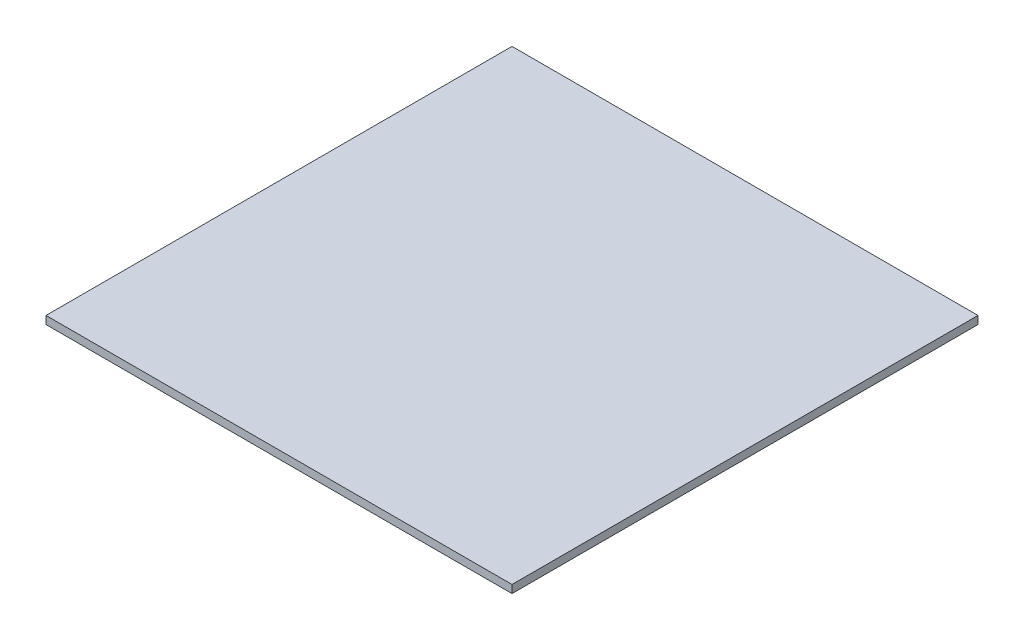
ISO-10303-21;
HEADER;
FILE_DESCRIPTION(('STEP AP214'),'2;1');
FILE_NAME('part.step','',(''),(''),'','','');
FILE_SCHEMA(('AUTOMOTIVE_DESIGN { 1 0 10303 214 1 1 1 1 }'));
ENDSEC;
DATA;
#1=APPLICATION_CONTEXT('core data for automotive mechanical design processes');
#2=APPLICATION_PROTOCOL_DEFINITION('international standard','automotive_design',2000,#1);
#3=PRODUCT_CONTEXT('',#1,'mechanical');
#4=PRODUCT('Part','Part','',(#3));
#5=PRODUCT_RELATED_PRODUCT_CATEGORY('part','',(#4));
#6=PRODUCT_DEFINITION_FORMATION('','',#4);
#7=PRODUCT_DEFINITION_CONTEXT('part definition',#1,'design');
#8=PRODUCT_DEFINITION('design','',#6,#7);
#9=PRODUCT_DEFINITION_SHAPE('','',#8);
#10=(LENGTH_UNIT() NAMED_UNIT(*) SI_UNIT(.MILLI.,.METRE.));
#11=(NAMED_UNIT(*) PLANE_ANGLE_UNIT() SI_UNIT($,.RADIAN.));
#12=(NAMED_UNIT(*) SI_UNIT($,.STERADIAN.) SOLID_ANGLE_UNIT());
#13=UNCERTAINTY_MEASURE_WITH_UNIT(LENGTH_MEASURE(1.E-05),#10,'distance_accuracy_value','');
#14=(GEOMETRIC_REPRESENTATION_CONTEXT(3) GLOBAL_UNCERTAINTY_ASSIGNED_CONTEXT((#13)) GLOBAL_UNIT_ASSIGNED_CONTEXT((#10,
#11,#12)) REPRESENTATION_CONTEXT('',''));
#15=CARTESIAN_POINT('',(0.,0.,0.));
#16=DIRECTION('',(0.,0.,1.));
#17=DIRECTION('',(1.,0.,0.));
#18=AXIS2_PLACEMENT_3D('',#15,#16,#17);
#19=CARTESIAN_POINT('',(5.,0.17,-5.));
#20=DIRECTION('',(-1.,0.,0.));
#21=DIRECTION('',(0.,0.,1.));
#22=AXIS2_PLACEMENT_3D('',#19,#20,#21);
#23=PLANE('',#22);
#24=DIRECTION('',(0.,0.,-1.));
#25=VECTOR('',#24,1.);
#26=CARTESIAN_POINT('',(5.,0.,-5.));
#27=LINE('',#26,#25);
#28=CARTESIAN_POINT('',(5.,0.,5.));
#29=VERTEX_POINT('',#28);
#30=CARTESIAN_POINT('',(5.,0.,-5.));
#31=VERTEX_POINT('',#30);
#32=EDGE_CURVE('E96',#29,#31,#27,.T.);
#33=ORIENTED_EDGE('',*,*,#32,.T.);
#34=DIRECTION('',(0.,-1.,0.));
#35=VECTOR('',#34,1.);
#36=CARTESIAN_POINT('',(5.,0.17,-5.));
#37=LINE('',#36,#35);
#38=CARTESIAN_POINT('',(5.,0.17,-5.));
#39=VERTEX_POINT('',#38);
#40=EDGE_CURVE('E11',#39,#31,#37,.T.);
#41=ORIENTED_EDGE('',*,*,#40,.F.);
#42=DIRECTION('',(0.,0.,-1.));
#43=VECTOR('',#42,1.);
#44=CARTESIAN_POINT('',(5.,0.17,-5.));
#45=LINE('',#44,#43);
#46=CARTESIAN_POINT('',(5.,0.17,5.));
#47=VERTEX_POINT('',#46);
#48=EDGE_CURVE('E84',#47,#39,#45,.T.);
#49=ORIENTED_EDGE('',*,*,#48,.F.);
#50=DIRECTION('',(0.,-1.,0.));
#51=VECTOR('',#50,1.);
#52=CARTESIAN_POINT('',(5.,0.17,5.));
#53=LINE('',#52,#51);
#54=EDGE_CURVE('E92',#47,#29,#53,.T.);
#55=ORIENTED_EDGE('',*,*,#54,.T.);
#56=EDGE_LOOP('',(#33,#41,#49,#55));
#57=FACE_BOUND('',#56,.T.);
#58=ADVANCED_FACE('F33',(#57),#23,.F.);
#59=CARTESIAN_POINT('',(-5.,0.17,-5.));
#60=DIRECTION('',(0.,0.,1.));
#61=DIRECTION('',(1.,0.,0.));
#62=AXIS2_PLACEMENT_3D('',#59,#60,#61);
#63=PLANE('',#62);
#64=DIRECTION('',(-1.,0.,0.));
#65=VECTOR('',#64,1.);
#66=CARTESIAN_POINT('',(-5.,0.,-5.));
#67=LINE('',#66,#65);
#68=CARTESIAN_POINT('',(-5.,0.,-5.));
#69=VERTEX_POINT('',#68);
#70=EDGE_CURVE('E88',#31,#69,#67,.T.);
#71=ORIENTED_EDGE('',*,*,#70,.T.);
#72=DIRECTION('',(0.,-1.,0.));
#73=VECTOR('',#72,1.);
#74=CARTESIAN_POINT('',(-5.,0.17,-5.));
#75=LINE('',#74,#73);
#76=CARTESIAN_POINT('',(-5.,0.17,-5.));
#77=VERTEX_POINT('',#76);
#78=EDGE_CURVE('E41',#77,#69,#75,.T.);
#79=ORIENTED_EDGE('',*,*,#78,.F.);
#80=DIRECTION('',(-1.,0.,0.));
#81=VECTOR('',#80,1.);
#82=CARTESIAN_POINT('',(-5.,0.17,-5.));
#83=LINE('',#82,#81);
#84=EDGE_CURVE('E79',#39,#77,#83,.T.);
#85=ORIENTED_EDGE('',*,*,#84,.F.);
#86=ORIENTED_EDGE('',*,*,#40,.T.);
#87=EDGE_LOOP('',(#71,#79,#85,#86));
#88=FACE_BOUND('',#87,.T.);
#89=ADVANCED_FACE('F87',(#88),#63,.F.);
#90=CARTESIAN_POINT('',(-5.,0.17,-5.));
#91=DIRECTION('',(1.,0.,0.));
#92=DIRECTION('',(0.,0.,-1.));
#93=AXIS2_PLACEMENT_3D('',#90,#91,#92);
#94=PLANE('',#93);
#95=DIRECTION('',(0.,0.,1.));
#96=VECTOR('',#95,1.);
#97=CARTESIAN_POINT('',(-5.,0.,-5.));
#98=LINE('',#97,#96);
#99=CARTESIAN_POINT('',(-5.,0.,5.));
#100=VERTEX_POINT('',#99);
#101=EDGE_CURVE('E66',#69,#100,#98,.T.);
#102=ORIENTED_EDGE('',*,*,#101,.T.);
#103=DIRECTION('',(0.,-1.,0.));
#104=VECTOR('',#103,1.);
#105=CARTESIAN_POINT('',(-5.,0.17,5.));
#106=LINE('',#105,#104);
#107=CARTESIAN_POINT('',(-5.,0.17,5.));
#108=VERTEX_POINT('',#107);
#109=EDGE_CURVE('E89',#108,#100,#106,.T.);
#110=ORIENTED_EDGE('',*,*,#109,.F.);
#111=DIRECTION('',(0.,0.,1.));
#112=VECTOR('',#111,1.);
#113=CARTESIAN_POINT('',(-5.,0.17,-5.));
#114=LINE('',#113,#112);
#115=EDGE_CURVE('E82',#77,#108,#114,.T.);
#116=ORIENTED_EDGE('',*,*,#115,.F.);
#117=ORIENTED_EDGE('',*,*,#78,.T.);
#118=EDGE_LOOP('',(#102,#110,#116,#117));
#119=FACE_BOUND('',#118,.T.);
#120=ADVANCED_FACE('F90',(#119),#94,.F.);
#121=CARTESIAN_POINT('',(-5.,0.17,5.));
#122=DIRECTION('',(0.,0.,-1.));
#123=DIRECTION('',(-1.,0.,0.));
#124=AXIS2_PLACEMENT_3D('',#121,#122,#123);
#125=PLANE('',#124);
#126=DIRECTION('',(1.,0.,0.));
#127=VECTOR('',#126,1.);
#128=CARTESIAN_POINT('',(-5.,0.,5.));
#129=LINE('',#128,#127);
#130=EDGE_CURVE('E72',#100,#29,#129,.T.);
#131=ORIENTED_EDGE('',*,*,#130,.T.);
#132=ORIENTED_EDGE('',*,*,#54,.F.);
#133=DIRECTION('',(1.,0.,0.));
#134=VECTOR('',#133,1.);
#135=CARTESIAN_POINT('',(-5.,0.17,5.));
#136=LINE('',#135,#134);
#137=EDGE_CURVE('E49',#108,#47,#136,.T.);
#138=ORIENTED_EDGE('',*,*,#137,.F.);
#139=ORIENTED_EDGE('',*,*,#109,.T.);
#140=EDGE_LOOP('',(#131,#132,#138,#139));
#141=FACE_BOUND('',#140,.T.);
#142=ADVANCED_FACE('F103',(#141),#125,.F.);
#143=CARTESIAN_POINT('',(0.,0.17,0.));
#144=DIRECTION('',(0.,1.,0.));
#145=DIRECTION('',(0.,0.,1.));
#146=AXIS2_PLACEMENT_3D('',#143,#144,#145);
#147=PLANE('',#146);
#148=ORIENTED_EDGE('',*,*,#48,.T.);
#149=ORIENTED_EDGE('',*,*,#84,.T.);
#150=ORIENTED_EDGE('',*,*,#115,.T.);
#151=ORIENTED_EDGE('',*,*,#137,.T.);
#152=EDGE_LOOP('',(#148,#149,#150,#151));
#153=FACE_BOUND('',#152,.T.);
#154=ADVANCED_FACE('F80',(#153),#147,.T.);
#155=CARTESIAN_POINT('',(0.,0.,0.));
#156=DIRECTION('',(0.,1.,0.));
#157=DIRECTION('',(0.,0.,1.));
#158=AXIS2_PLACEMENT_3D('',#155,#156,#157);
#159=PLANE('',#158);
#160=ORIENTED_EDGE('',*,*,#32,.F.);
#161=ORIENTED_EDGE('',*,*,#130,.F.);
#162=ORIENTED_EDGE('',*,*,#101,.F.);
#163=ORIENTED_EDGE('',*,*,#70,.F.);
#164=EDGE_LOOP('',(#160,#161,#162,#163));
#165=FACE_BOUND('',#164,.T.);
#166=ADVANCED_FACE('F106',(#165),#159,.F.);
#167=CLOSED_SHELL('',(#58,#89,#120,#142,#154,#166));
#168=MANIFOLD_SOLID_BREP('B2',#167);
#169=ADVANCED_BREP_SHAPE_REPRESENTATION('',(#18,#168),#14);
#170=SHAPE_DEFINITION_REPRESENTATION(#9,#169);
ENDSEC;
END-ISO-10303-21;
